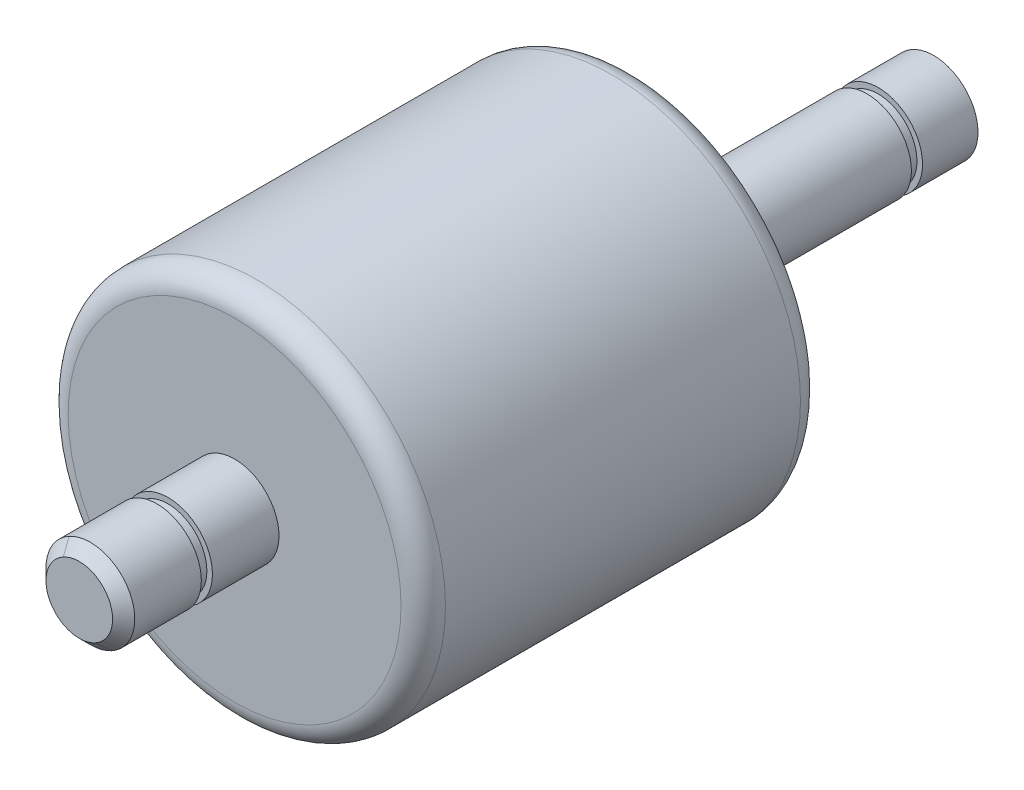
ISO-10303-21;
HEADER;
FILE_DESCRIPTION(('STEP AP214'),'2;1');
FILE_NAME('part.step','',(''),(''),'','','');
FILE_SCHEMA(('AUTOMOTIVE_DESIGN { 1 0 10303 214 1 1 1 1 }'));
ENDSEC;
DATA;
#1=APPLICATION_CONTEXT('core data for automotive mechanical design processes');
#2=APPLICATION_PROTOCOL_DEFINITION('international standard','automotive_design',2000,#1);
#3=PRODUCT_CONTEXT('',#1,'mechanical');
#4=PRODUCT('Part','Part','',(#3));
#5=PRODUCT_RELATED_PRODUCT_CATEGORY('part','',(#4));
#6=PRODUCT_DEFINITION_FORMATION('','',#4);
#7=PRODUCT_DEFINITION_CONTEXT('part definition',#1,'design');
#8=PRODUCT_DEFINITION('design','',#6,#7);
#9=PRODUCT_DEFINITION_SHAPE('','',#8);
#10=(LENGTH_UNIT() NAMED_UNIT(*) SI_UNIT(.MILLI.,.METRE.));
#11=(NAMED_UNIT(*) PLANE_ANGLE_UNIT() SI_UNIT($,.RADIAN.));
#12=(NAMED_UNIT(*) SI_UNIT($,.STERADIAN.) SOLID_ANGLE_UNIT());
#13=UNCERTAINTY_MEASURE_WITH_UNIT(LENGTH_MEASURE(1.E-05),#10,'distance_accuracy_value','');
#14=(GEOMETRIC_REPRESENTATION_CONTEXT(3) GLOBAL_UNCERTAINTY_ASSIGNED_CONTEXT((#13)) GLOBAL_UNIT_ASSIGNED_CONTEXT((#10,
#11,#12)) REPRESENTATION_CONTEXT('',''));
#15=CARTESIAN_POINT('',(0.,0.,0.));
#16=DIRECTION('',(0.,0.,1.));
#17=DIRECTION('',(1.,0.,0.));
#18=AXIS2_PLACEMENT_3D('',#15,#16,#17);
#19=CARTESIAN_POINT('',(0.,-4.,93.));
#20=DIRECTION('',(0.,0.,1.));
#21=DIRECTION('',(1.,0.,0.));
#22=AXIS2_PLACEMENT_3D('',#19,#20,#21);
#23=PLANE('',#22);
#24=CARTESIAN_POINT('',(2.10843322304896E-13,2.55510338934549E-13,93.000000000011));
#25=DIRECTION('',(-2.10409641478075E-13,-2.55293498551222E-13,-1.));
#26=DIRECTION('',(0.,1.,-2.55293498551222E-13));
#27=AXIS2_PLACEMENT_3D('',#24,#25,#26);
#28=CIRCLE('',#27,2.99999999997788);
#29=CARTESIAN_POINT('',(-1.43827649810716,2.6327477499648,93.0000000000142));
#30=VERTEX_POINT('',#29);
#31=CARTESIAN_POINT('',(1.43827661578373,-2.63274768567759,93.0000000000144));
#32=VERTEX_POINT('',#31);
#33=EDGE_CURVE('E67',#30,#32,#28,.T.);
#34=ORIENTED_EDGE('',*,*,#33,.F.);
#35=CARTESIAN_POINT('',(0.,0.,93.0000000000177));
#36=DIRECTION('',(0.,0.,-1.));
#37=DIRECTION('',(-1.,0.,0.));
#38=AXIS2_PLACEMENT_3D('',#35,#36,#37);
#39=CIRCLE('',#38,3.00000000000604);
#40=EDGE_CURVE('E56',#32,#30,#39,.T.);
#41=ORIENTED_EDGE('',*,*,#40,.F.);
#42=EDGE_LOOP('',(#34,#41));
#43=FACE_BOUND('',#42,.T.);
#44=ADVANCED_FACE('F16',(#43),#23,.T.);
#45=CARTESIAN_POINT('',(0.,0.,91.9999999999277));
#46=DIRECTION('',(0.,0.,-1.));
#47=DIRECTION('',(-1.,0.,0.));
#48=AXIS2_PLACEMENT_3D('',#45,#46,#47);
#49=CONICAL_SURFACE('',#48,4.00000000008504,0.785398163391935);
#50=DIRECTION('',(-0.339005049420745,0.620544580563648,0.707106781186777));
#51=VECTOR('',#50,1.);
#52=CARTESIAN_POINT('',(239279.368614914,-437997.946309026,-499000.));
#53=LINE('',#52,#51);
#54=CARTESIAN_POINT('',(1.91770215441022,-3.51033024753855,92.0000000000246));
#55=VERTEX_POINT('',#54);
#56=EDGE_CURVE('E64',#32,#55,#53,.F.);
#57=ORIENTED_EDGE('',*,*,#56,.F.);
#58=ORIENTED_EDGE('',*,*,#40,.T.);
#59=CARTESIAN_POINT('',(-1.91770215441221,3.51033024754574,92.0000000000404));
#60=CARTESIAN_POINT('',(-1.89772608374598,3.47376431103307,92.0416666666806));
#61=CARTESIAN_POINT('',(-1.87775001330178,3.43719837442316,92.0833333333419));
#62=CARTESIAN_POINT('',(-1.83779787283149,3.36406650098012,92.1666666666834));
#63=CARTESIAN_POINT('',(-1.8178218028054,3.32750056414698,92.2083333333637));
#64=CARTESIAN_POINT('',(-1.77786966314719,3.25436869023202,92.291666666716));
#65=CARTESIAN_POINT('',(-1.75789359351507,3.21780275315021,92.3333333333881));
#66=CARTESIAN_POINT('',(-1.71794145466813,3.14467087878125,92.416666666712));
#67=CARTESIAN_POINT('',(-1.6979653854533,3.1081049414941,92.4583333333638));
#68=CARTESIAN_POINT('',(-1.65801324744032,3.03497306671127,92.5416666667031));
#69=CARTESIAN_POINT('',(-1.63803717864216,2.99840712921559,92.5833333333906));
#70=CARTESIAN_POINT('',(-1.59808504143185,2.92527525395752,92.6666666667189));
#71=CARTESIAN_POINT('',(-1.5781089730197,2.88870931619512,92.7083333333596));
#72=CARTESIAN_POINT('',(-1.53815683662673,2.81557744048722,92.791666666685));
#73=CARTESIAN_POINT('',(-1.51818076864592,2.77901150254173,92.8333333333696));
#74=CARTESIAN_POINT('',(-1.47822863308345,2.70587962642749,92.9166666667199));
#75=CARTESIAN_POINT('',(-1.45825256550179,2.66931368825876,92.9583333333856));
#76=CARTESIAN_POINT('',(-1.43827649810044,2.6327477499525,93.000000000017));
#77=B_SPLINE_CURVE_WITH_KNOTS('',3,(#59,#60,#61,#62,#63,#64,#65,#66,#67,#68,#69,#70,#71,#72,#73,
#74,#75,#76),.UNSPECIFIED.,.F.,.F.,(4,2,2,2,2,2,2,2,4),(0.,0.176776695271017,0.353553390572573,
0.530330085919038,0.7071067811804,0.883883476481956,1.06066017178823,1.23743686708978,
1.41421356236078),.UNSPECIFIED.);
#78=CARTESIAN_POINT('',(-1.91770215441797,3.51033024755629,92.0000000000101));
#79=VERTEX_POINT('',#78);
#80=EDGE_CURVE('E61',#79,#30,#77,.T.);
#81=ORIENTED_EDGE('',*,*,#80,.F.);
#82=CARTESIAN_POINT('',(0.,0.,92.));
#83=DIRECTION('',(0.,0.,1.));
#84=DIRECTION('',(1.,0.,0.));
#85=AXIS2_PLACEMENT_3D('',#82,#83,#84);
#86=CIRCLE('',#85,4.);
#87=EDGE_CURVE('E69',#55,#79,#86,.F.);
#88=ORIENTED_EDGE('',*,*,#87,.F.);
#89=EDGE_LOOP('',(#57,#58,#81,#88));
#90=FACE_BOUND('',#89,.T.);
#91=ADVANCED_FACE('F59',(#90),#49,.T.);
#92=CARTESIAN_POINT('',(0.,0.,92.0000000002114));
#93=DIRECTION('',(-2.10409641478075E-13,-2.55293498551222E-13,-1.));
#94=DIRECTION('',(0.,1.,-2.55293498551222E-13));
#95=AXIS2_PLACEMENT_3D('',#92,#93,#94);
#96=CONICAL_SURFACE('',#95,3.99999999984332,0.78539816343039);
#97=ORIENTED_EDGE('',*,*,#80,.T.);
#98=ORIENTED_EDGE('',*,*,#33,.T.);
#99=ORIENTED_EDGE('',*,*,#56,.T.);
#100=CARTESIAN_POINT('',(0.,0.,92.));
#101=DIRECTION('',(0.,0.,1.));
#102=DIRECTION('',(1.,0.,0.));
#103=AXIS2_PLACEMENT_3D('',#100,#101,#102);
#104=CIRCLE('',#103,4.);
#105=EDGE_CURVE('E74',#79,#55,#104,.F.);
#106=ORIENTED_EDGE('',*,*,#105,.F.);
#107=EDGE_LOOP('',(#97,#98,#99,#106));
#108=FACE_BOUND('',#107,.T.);
#109=ADVANCED_FACE('F72',(#108),#96,.T.);
#110=CARTESIAN_POINT('',(0.,-4.,16.));
#111=DIRECTION('',(0.,0.,1.));
#112=DIRECTION('',(1.,0.,0.));
#113=AXIS2_PLACEMENT_3D('',#110,#111,#112);
#114=PLANE('',#113);
#115=CARTESIAN_POINT('',(0.,0.,16.));
#116=DIRECTION('',(0.,0.,1.));
#117=DIRECTION('',(1.,0.,0.));
#118=AXIS2_PLACEMENT_3D('',#115,#116,#117);
#119=CIRCLE('',#118,4.);
#120=CARTESIAN_POINT('',(4.,0.,16.));
#121=VERTEX_POINT('',#120);
#122=EDGE_CURVE('E102',#121,#121,#119,.T.);
#123=ORIENTED_EDGE('',*,*,#122,.F.);
#124=EDGE_LOOP('',(#123));
#125=FACE_BOUND('',#124,.T.);
#126=ADVANCED_FACE('F94',(#125),#114,.F.);
#127=CARTESIAN_POINT('',(0.,0.,54.5));
#128=DIRECTION('',(0.,0.,1.));
#129=DIRECTION('',(1.,0.,0.));
#130=AXIS2_PLACEMENT_3D('',#127,#128,#129);
#131=CYLINDRICAL_SURFACE('',#130,4.);
#132=CARTESIAN_POINT('',(0.,0.,86.));
#133=DIRECTION('',(0.,0.,1.));
#134=DIRECTION('',(1.,0.,0.));
#135=AXIS2_PLACEMENT_3D('',#132,#133,#134);
#136=CIRCLE('',#135,4.);
#137=CARTESIAN_POINT('',(4.,0.,86.));
#138=VERTEX_POINT('',#137);
#139=EDGE_CURVE('E105',#138,#138,#136,.T.);
#140=ORIENTED_EDGE('',*,*,#139,.T.);
#141=EDGE_LOOP('',(#140));
#142=FACE_BOUND('',#141,.T.);
#143=ORIENTED_EDGE('',*,*,#105,.T.);
#144=ORIENTED_EDGE('',*,*,#87,.T.);
#145=EDGE_LOOP('',(#143,#144));
#146=FACE_BOUND('',#145,.T.);
#147=ADVANCED_FACE('F240',(#142,#146),#131,.T.);
#148=CARTESIAN_POINT('',(0.,0.,54.5));
#149=DIRECTION('',(0.,0.,1.));
#150=DIRECTION('',(1.,0.,0.));
#151=AXIS2_PLACEMENT_3D('',#148,#149,#150);
#152=CYLINDRICAL_SURFACE('',#151,4.);
#153=ORIENTED_EDGE('',*,*,#122,.T.);
#154=EDGE_LOOP('',(#153));
#155=FACE_BOUND('',#154,.T.);
#156=CARTESIAN_POINT('',(0.,0.,21.));
#157=DIRECTION('',(0.,0.,1.));
#158=DIRECTION('',(1.,0.,0.));
#159=AXIS2_PLACEMENT_3D('',#156,#157,#158);
#160=CIRCLE('',#159,4.);
#161=CARTESIAN_POINT('',(4.,0.,21.));
#162=VERTEX_POINT('',#161);
#163=EDGE_CURVE('E110',#162,#162,#160,.T.);
#164=ORIENTED_EDGE('',*,*,#163,.F.);
#165=EDGE_LOOP('',(#164));
#166=FACE_BOUND('',#165,.T.);
#167=ADVANCED_FACE('F237',(#155,#166),#152,.T.);
#168=CARTESIAN_POINT('',(0.,-11.1014213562,86.));
#169=DIRECTION('',(0.,0.,1.));
#170=DIRECTION('',(1.,0.,0.));
#171=AXIS2_PLACEMENT_3D('',#168,#169,#170);
#172=PLANE('',#171);
#173=CARTESIAN_POINT('',(0.,0.,86.));
#174=DIRECTION('',(0.,0.,1.));
#175=DIRECTION('',(1.,0.,0.));
#176=AXIS2_PLACEMENT_3D('',#173,#174,#175);
#177=CIRCLE('',#176,3.5);
#178=CARTESIAN_POINT('',(3.5,0.,86.));
#179=VERTEX_POINT('',#178);
#180=EDGE_CURVE('E230',#179,#179,#177,.F.);
#181=ORIENTED_EDGE('',*,*,#180,.F.);
#182=EDGE_LOOP('',(#181));
#183=FACE_BOUND('',#182,.T.);
#184=ORIENTED_EDGE('',*,*,#139,.F.);
#185=EDGE_LOOP('',(#184));
#186=FACE_BOUND('',#185,.T.);
#187=ADVANCED_FACE('F239',(#183,#186),#172,.F.);
#188=CARTESIAN_POINT('',(0.,-3.5,21.));
#189=DIRECTION('',(0.,0.,1.));
#190=DIRECTION('',(1.,0.,0.));
#191=AXIS2_PLACEMENT_3D('',#188,#189,#190);
#192=PLANE('',#191);
#193=CARTESIAN_POINT('',(0.,0.,21.));
#194=DIRECTION('',(0.,0.,1.));
#195=DIRECTION('',(1.,0.,0.));
#196=AXIS2_PLACEMENT_3D('',#193,#194,#195);
#197=CIRCLE('',#196,3.5);
#198=CARTESIAN_POINT('',(3.5,0.,21.));
#199=VERTEX_POINT('',#198);
#200=EDGE_CURVE('E227',#199,#199,#197,.T.);
#201=ORIENTED_EDGE('',*,*,#200,.F.);
#202=EDGE_LOOP('',(#201));
#203=FACE_BOUND('',#202,.T.);
#204=ORIENTED_EDGE('',*,*,#163,.T.);
#205=EDGE_LOOP('',(#204));
#206=FACE_BOUND('',#205,.T.);
#207=ADVANCED_FACE('F235',(#203,#206),#192,.T.);
#208=CARTESIAN_POINT('',(0.,0.,53.5));
#209=DIRECTION('',(0.,0.,1.));
#210=DIRECTION('',(1.,0.,0.));
#211=AXIS2_PLACEMENT_3D('',#208,#209,#210);
#212=CYLINDRICAL_SURFACE('',#211,3.5);
#213=ORIENTED_EDGE('',*,*,#180,.T.);
#214=EDGE_LOOP('',(#213));
#215=FACE_BOUND('',#214,.T.);
#216=CARTESIAN_POINT('',(0.,0.,85.));
#217=DIRECTION('',(0.,0.,1.));
#218=DIRECTION('',(1.,0.,0.));
#219=AXIS2_PLACEMENT_3D('',#216,#217,#218);
#220=CIRCLE('',#219,3.5);
#221=CARTESIAN_POINT('',(3.5,0.,85.));
#222=VERTEX_POINT('',#221);
#223=EDGE_CURVE('E224',#222,#222,#220,.F.);
#224=ORIENTED_EDGE('',*,*,#223,.F.);
#225=EDGE_LOOP('',(#224));
#226=FACE_BOUND('',#225,.T.);
#227=ADVANCED_FACE('F338',(#215,#226),#212,.T.);
#228=CARTESIAN_POINT('',(0.,0.,53.5));
#229=DIRECTION('',(0.,0.,1.));
#230=DIRECTION('',(1.,0.,0.));
#231=AXIS2_PLACEMENT_3D('',#228,#229,#230);
#232=CYLINDRICAL_SURFACE('',#231,3.5);
#233=CARTESIAN_POINT('',(0.,0.,22.));
#234=DIRECTION('',(0.,0.,1.));
#235=DIRECTION('',(1.,0.,0.));
#236=AXIS2_PLACEMENT_3D('',#233,#234,#235);
#237=CIRCLE('',#236,3.5);
#238=CARTESIAN_POINT('',(3.5,0.,22.));
#239=VERTEX_POINT('',#238);
#240=EDGE_CURVE('E221',#239,#239,#237,.F.);
#241=ORIENTED_EDGE('',*,*,#240,.T.);
#242=EDGE_LOOP('',(#241));
#243=FACE_BOUND('',#242,.T.);
#244=ORIENTED_EDGE('',*,*,#200,.T.);
#245=EDGE_LOOP('',(#244));
#246=FACE_BOUND('',#245,.T.);
#247=ADVANCED_FACE('F329',(#243,#246),#232,.T.);
#248=CARTESIAN_POINT('',(0.,-3.5,85.));
#249=DIRECTION('',(0.,0.,1.));
#250=DIRECTION('',(1.,0.,0.));
#251=AXIS2_PLACEMENT_3D('',#248,#249,#250);
#252=PLANE('',#251);
#253=ORIENTED_EDGE('',*,*,#223,.T.);
#254=EDGE_LOOP('',(#253));
#255=FACE_BOUND('',#254,.T.);
#256=CARTESIAN_POINT('',(0.,0.,85.));
#257=DIRECTION('',(0.,0.,1.));
#258=DIRECTION('',(1.,0.,0.));
#259=AXIS2_PLACEMENT_3D('',#256,#257,#258);
#260=CIRCLE('',#259,4.);
#261=CARTESIAN_POINT('',(4.,0.,85.));
#262=VERTEX_POINT('',#261);
#263=EDGE_CURVE('E218',#262,#262,#260,.F.);
#264=ORIENTED_EDGE('',*,*,#263,.F.);
#265=EDGE_LOOP('',(#264));
#266=FACE_BOUND('',#265,.T.);
#267=ADVANCED_FACE('F320',(#255,#266),#252,.T.);
#268=CARTESIAN_POINT('',(0.,-11.1014213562,22.));
#269=DIRECTION('',(0.,0.,1.));
#270=DIRECTION('',(1.,0.,0.));
#271=AXIS2_PLACEMENT_3D('',#268,#269,#270);
#272=PLANE('',#271);
#273=ORIENTED_EDGE('',*,*,#240,.F.);
#274=EDGE_LOOP('',(#273));
#275=FACE_BOUND('',#274,.T.);
#276=CARTESIAN_POINT('',(0.,0.,22.));
#277=DIRECTION('',(0.,0.,1.));
#278=DIRECTION('',(1.,0.,0.));
#279=AXIS2_PLACEMENT_3D('',#276,#277,#278);
#280=CIRCLE('',#279,4.);
#281=CARTESIAN_POINT('',(4.,0.,22.));
#282=VERTEX_POINT('',#281);
#283=EDGE_CURVE('E215',#282,#282,#280,.T.);
#284=ORIENTED_EDGE('',*,*,#283,.F.);
#285=EDGE_LOOP('',(#284));
#286=FACE_BOUND('',#285,.T.);
#287=ADVANCED_FACE('F311',(#275,#286),#272,.F.);
#288=CARTESIAN_POINT('',(0.,0.,54.5));
#289=DIRECTION('',(0.,0.,1.));
#290=DIRECTION('',(1.,0.,0.));
#291=AXIS2_PLACEMENT_3D('',#288,#289,#290);
#292=CYLINDRICAL_SURFACE('',#291,4.);
#293=CARTESIAN_POINT('',(0.,0.,79.));
#294=DIRECTION('',(0.,0.,1.));
#295=DIRECTION('',(1.,0.,0.));
#296=AXIS2_PLACEMENT_3D('',#293,#294,#295);
#297=CIRCLE('',#296,4.);
#298=CARTESIAN_POINT('',(4.,0.,79.));
#299=VERTEX_POINT('',#298);
#300=EDGE_CURVE('E210',#299,#299,#297,.F.);
#301=ORIENTED_EDGE('',*,*,#300,.F.);
#302=EDGE_LOOP('',(#301));
#303=FACE_BOUND('',#302,.T.);
#304=ORIENTED_EDGE('',*,*,#263,.T.);
#305=EDGE_LOOP('',(#304));
#306=FACE_BOUND('',#305,.T.);
#307=ADVANCED_FACE('F304',(#303,#306),#292,.T.);
#308=CARTESIAN_POINT('',(0.,0.,54.5));
#309=DIRECTION('',(0.,0.,1.));
#310=DIRECTION('',(1.,0.,0.));
#311=AXIS2_PLACEMENT_3D('',#308,#309,#310);
#312=CYLINDRICAL_SURFACE('',#311,4.);
#313=CARTESIAN_POINT('',(0.,0.,43.));
#314=DIRECTION('',(0.,0.,1.));
#315=DIRECTION('',(1.,0.,0.));
#316=AXIS2_PLACEMENT_3D('',#313,#314,#315);
#317=CIRCLE('',#316,4.);
#318=CARTESIAN_POINT('',(4.,0.,43.));
#319=VERTEX_POINT('',#318);
#320=EDGE_CURVE('E205',#319,#319,#317,.F.);
#321=ORIENTED_EDGE('',*,*,#320,.T.);
#322=EDGE_LOOP('',(#321));
#323=FACE_BOUND('',#322,.T.);
#324=ORIENTED_EDGE('',*,*,#283,.T.);
#325=EDGE_LOOP('',(#324));
#326=FACE_BOUND('',#325,.T.);
#327=ADVANCED_FACE('F296',(#323,#326),#312,.T.);
#328=CARTESIAN_POINT('',(0.,-17.,79.));
#329=DIRECTION('',(0.,0.,1.));
#330=DIRECTION('',(1.,0.,0.));
#331=AXIS2_PLACEMENT_3D('',#328,#329,#330);
#332=PLANE('',#331);
#333=ORIENTED_EDGE('',*,*,#300,.T.);
#334=EDGE_LOOP('',(#333));
#335=FACE_BOUND('',#334,.T.);
#336=CARTESIAN_POINT('',(0.,0.,79.));
#337=DIRECTION('',(0.,0.,-1.));
#338=DIRECTION('',(-0.479425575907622,0.877582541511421,0.));
#339=AXIS2_PLACEMENT_3D('',#336,#337,#338);
#340=CIRCLE('',#339,15.0000000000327);
#341=CARTESIAN_POINT('',(-7.19138352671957,13.1637381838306,79.));
#342=VERTEX_POINT('',#341);
#343=CARTESIAN_POINT('',(7.19138307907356,-13.1637384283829,79.));
#344=VERTEX_POINT('',#343);
#345=EDGE_CURVE('E177',#342,#344,#340,.T.);
#346=ORIENTED_EDGE('',*,*,#345,.F.);
#347=CARTESIAN_POINT('',(0.,0.,79.));
#348=DIRECTION('',(0.,0.,-1.));
#349=DIRECTION('',(0.479425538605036,-0.877582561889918,0.));
#350=AXIS2_PLACEMENT_3D('',#347,#348,#349);
#351=CIRCLE('',#350,15.0000000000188);
#352=EDGE_CURVE('E188',#344,#342,#351,.T.);
#353=ORIENTED_EDGE('',*,*,#352,.F.);
#354=EDGE_LOOP('',(#346,#353));
#355=FACE_BOUND('',#354,.T.);
#356=ADVANCED_FACE('F152',(#335,#355),#332,.T.);
#357=CARTESIAN_POINT('',(0.,-4.,43.));
#358=DIRECTION('',(0.,0.,1.));
#359=DIRECTION('',(1.,0.,0.));
#360=AXIS2_PLACEMENT_3D('',#357,#358,#359);
#361=PLANE('',#360);
#362=ORIENTED_EDGE('',*,*,#320,.F.);
#363=EDGE_LOOP('',(#362));
#364=FACE_BOUND('',#363,.T.);
#365=CARTESIAN_POINT('',(7.19138307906,-13.1637384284,43.));
#366=CARTESIAN_POINT('',(7.40677695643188,-13.0460741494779,43.));
#367=CARTESIAN_POINT('',(7.61927751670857,-12.9231146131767,43.));
#368=CARTESIAN_POINT('',(8.03799201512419,-12.666920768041,43.));
#369=CARTESIAN_POINT('',(8.24420595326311,-12.5336864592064,43.));
#370=CARTESIAN_POINT('',(8.64984721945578,-12.2572588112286,43.));
#371=CARTESIAN_POINT('',(8.84927454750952,-12.1140654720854,43.));
#372=CARTESIAN_POINT('',(9.24086301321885,-11.8180661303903,43.));
#373=CARTESIAN_POINT('',(9.43302415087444,-11.6652601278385,43.));
#374=CARTESIAN_POINT('',(9.80961707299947,-11.3504032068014,43.));
#375=CARTESIAN_POINT('',(9.9940488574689,-11.1883522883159,43.));
#376=CARTESIAN_POINT('',(10.3547388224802,-10.8553960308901,43.));
#377=CARTESIAN_POINT('',(10.5309970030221,-10.6844906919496,43.));
#378=CARTESIAN_POINT('',(10.8749151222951,-10.334237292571,43.));
#379=CARTESIAN_POINT('',(11.0425750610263,-10.1548892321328,43.));
#380=CARTESIAN_POINT('',(11.3688927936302,-9.7881824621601,43.));
#381=CARTESIAN_POINT('',(11.527550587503,-9.60082375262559,43.));
#382=CARTESIAN_POINT('',(11.8354818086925,-9.2185470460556,43.));
#383=CARTESIAN_POINT('',(11.9847552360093,-9.02362904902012,43.));
#384=CARTESIAN_POINT('',(12.2735581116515,-8.62670334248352,43.));
#385=CARTESIAN_POINT('',(12.413087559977,-8.42469563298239,43.));
#386=CARTESIAN_POINT('',(12.682066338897,-8.01407715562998,43.));
#387=CARTESIAN_POINT('',(12.8115156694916,-7.8054663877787,43.));
#388=CARTESIAN_POINT('',(13.0600223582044,-7.38214435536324,43.));
#389=CARTESIAN_POINT('',(13.1790797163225,-7.16743309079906,43.));
#390=CARTESIAN_POINT('',(13.4065156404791,-6.73242732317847,43.));
#391=CARTESIAN_POINT('',(13.5148942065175,-6.51213282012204,43.));
#392=CARTESIAN_POINT('',(13.720711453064,-6.06649128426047,43.));
#393=CARTESIAN_POINT('',(13.8181501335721,-5.84114425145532,43.));
#394=CARTESIAN_POINT('',(14.001852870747,-5.38594053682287,43.));
#395=CARTESIAN_POINT('',(14.0881169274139,-5.15608385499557,43.));
#396=CARTESIAN_POINT('',(14.2492625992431,-4.6924145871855,43.));
#397=CARTESIAN_POINT('',(14.3241442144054,-4.45860200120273,43.));
#398=CARTESIAN_POINT('',(14.46234460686,-3.98758420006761,43.));
#399=CARTESIAN_POINT('',(14.5256633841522,-3.75037898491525,43.));
#400=CARTESIAN_POINT('',(14.6405855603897,-3.27314737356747,43.));
#401=CARTESIAN_POINT('',(14.6921889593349,-3.03312097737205,43.));
#402=CARTESIAN_POINT('',(14.7835560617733,-2.55082524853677,43.));
#403=CARTESIAN_POINT('',(14.8233197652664,-2.3085559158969,43.));
#404=CARTESIAN_POINT('',(14.8909116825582,-1.82235796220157,43.));
#405=CARTESIAN_POINT('',(14.9187398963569,-1.5784293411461,43.));
#406=CARTESIAN_POINT('',(14.9623937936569,-1.08950045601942,43.));
#407=CARTESIAN_POINT('',(14.9782194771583,-0.844500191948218,43.));
#408=CARTESIAN_POINT('',(14.9978301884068,-0.354018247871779,43.));
#409=CARTESIAN_POINT('',(15.001615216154,-0.108536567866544,43.));
#410=CARTESIAN_POINT('',(14.997135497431,0.382316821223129,43.));
#411=CARTESIAN_POINT('',(14.9888707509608,0.627688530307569,43.));
#412=CARTESIAN_POINT('',(14.9603113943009,1.1177308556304,43.));
#413=CARTESIAN_POINT('',(14.9400167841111,1.36240147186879,43.));
#414=CARTESIAN_POINT('',(14.8874465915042,1.85045217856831,43.));
#415=CARTESIAN_POINT('',(14.8551710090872,2.09383226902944,43.));
#416=CARTESIAN_POINT('',(14.7787166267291,2.57871560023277,43.));
#417=CARTESIAN_POINT('',(14.734537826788,2.82021884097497,43.));
#418=CARTESIAN_POINT('',(14.6343834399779,3.30076667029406,43.));
#419=CARTESIAN_POINT('',(14.5784078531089,3.53981125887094,43.));
#420=CARTESIAN_POINT('',(14.4547947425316,4.01486590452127,43.));
#421=CARTESIAN_POINT('',(14.3871572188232,4.25087596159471,43.));
#422=CARTESIAN_POINT('',(14.2403831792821,4.71929297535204,43.));
#423=CARTESIAN_POINT('',(14.1612466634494,4.95169993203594,43.));
#424=CARTESIAN_POINT('',(13.9916652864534,5.41235085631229,43.));
#425=CARTESIAN_POINT('',(13.9012204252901,5.64059482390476,43.));
#426=CARTESIAN_POINT('',(13.7092402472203,6.09236991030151,43.));
#427=CARTESIAN_POINT('',(13.6077049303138,6.31590102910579,43.));
#428=CARTESIAN_POINT('',(13.3937884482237,6.75771191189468,43.));
#429=CARTESIAN_POINT('',(13.2814072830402,6.97599167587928,43.));
#430=CARTESIAN_POINT('',(13.0460698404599,7.40677399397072,43.));
#431=CARTESIAN_POINT('',(12.9231135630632,7.61927654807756,43.));
#432=CARTESIAN_POINT('',(12.6669221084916,8.0379925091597,43.));
#433=CARTESIAN_POINT('',(12.5336869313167,8.244205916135,43.));
#434=CARTESIAN_POINT('',(12.257258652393,8.64984679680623,43.));
#435=CARTESIAN_POINT('',(12.1140655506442,8.84927427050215,43.));
#436=CARTESIAN_POINT('',(11.8180663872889,9.24086284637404,43.));
#437=CARTESIAN_POINT('',(11.6652603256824,9.43302394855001,43.));
#438=CARTESIAN_POINT('',(11.3504033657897,9.80961684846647,43.));
#439=CARTESIAN_POINT('',(11.1883524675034,9.99404864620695,43.));
#440=CARTESIAN_POINT('',(10.8553962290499,10.3547386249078,43.));
#441=CARTESIAN_POINT('',(10.6844908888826,10.5309968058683,43.));
#442=CARTESIAN_POINT('',(10.3342374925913,10.8749149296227,43.));
#443=CARTESIAN_POINT('',(10.1548894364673,11.0425748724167,43.));
#444=CARTESIAN_POINT('',(9.78818267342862,11.3688926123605,43.));
#445=CARTESIAN_POINT('',(9.60082396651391,11.5275504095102,43.));
#446=CARTESIAN_POINT('',(9.21854726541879,11.8354816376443,43.));
#447=CARTESIAN_POINT('',(9.02362927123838,11.9847550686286,43.));
#448=CARTESIAN_POINT('',(8.62670357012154,12.2735579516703,43.));
#449=CARTESIAN_POINT('',(8.42469586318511,12.4130874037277,43.));
#450=CARTESIAN_POINT('',(8.01407739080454,12.6820661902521,43.));
#451=CARTESIAN_POINT('',(7.80546662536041,12.8115155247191,43.));
#452=CARTESIAN_POINT('',(7.38214459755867,13.060022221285,43.));
#453=CARTESIAN_POINT('',(7.16743333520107,13.1790795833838,43.));
#454=CARTESIAN_POINT('',(6.73242757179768,13.4065155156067,43.));
#455=CARTESIAN_POINT('',(6.5121330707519,13.5148940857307,43.));
#456=CARTESIAN_POINT('',(6.06649153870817,13.7207113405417,43.));
#457=CARTESIAN_POINT('',(5.84114450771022,13.8181500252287,43.));
#458=CARTESIAN_POINT('',(5.38594079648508,14.0018527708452,43.));
#459=CARTESIAN_POINT('',(5.15608411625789,14.0881168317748,43.));
#460=CARTESIAN_POINT('',(4.69241485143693,14.2492625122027,43.));
#461=CARTESIAN_POINT('',(4.45860226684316,14.3241441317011,43.));
#462=CARTESIAN_POINT('',(3.9875844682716,14.4623445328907,43.));
#463=CARTESIAN_POINT('',(3.75037925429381,14.5256633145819,43.));
#464=CARTESIAN_POINT('',(3.2731476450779,14.6405854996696,43.));
#465=CARTESIAN_POINT('',(3.03312124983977,14.6921889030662,43.));
#466=CARTESIAN_POINT('',(2.55082552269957,14.7835560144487,43.));
#467=CARTESIAN_POINT('',(2.3085561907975,14.8233197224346,43.));
#468=CARTESIAN_POINT('',(1.82235823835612,14.8909116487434,43.));
#469=CARTESIAN_POINT('',(1.57842961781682,14.9187398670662,43.));
#470=CARTESIAN_POINT('',(1.08950073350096,14.9623937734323,43.));
#471=CARTESIAN_POINT('',(0.844500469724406,14.9782194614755,43.));
#472=CARTESIAN_POINT('',(0.354018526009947,14.9978301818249,43.));
#473=CARTESIAN_POINT('',(0.10853684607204,15.0016152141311,43.));
#474=CARTESIAN_POINT('',(-0.38231654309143,14.9971355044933,43.));
#475=CARTESIAN_POINT('',(-0.627688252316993,14.9888707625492,43.));
#476=CARTESIAN_POINT('',(-1.11773057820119,14.9603114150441,43.));
#477=CARTESIAN_POINT('',(-1.36240119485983,14.9400168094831,43.));
#478=CARTESIAN_POINT('',(-1.85045190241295,14.887446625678,43.));
#479=CARTESIAN_POINT('',(-2.09383199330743,14.855171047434,43.));
#480=CARTESIAN_POINT('',(-2.57871532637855,14.7787166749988,43.));
#481=CARTESIAN_POINT('',(-2.82021856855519,14.7345378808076,43.));
#482=CARTESIAN_POINT('',(-3.30076639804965,14.6343834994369,43.));
#483=CARTESIAN_POINT('',(-3.53981098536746,14.5784079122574,43.));
#484=CARTESIAN_POINT('',(-4.01486563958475,14.4547948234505,43.));
#485=CARTESIAN_POINT('',(-4.25087570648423,14.3871573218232,43.));
#486=CARTESIAN_POINT('',(-4.71929269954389,14.2403832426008,43.));
#487=CARTESIAN_POINT('',(-4.95169962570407,14.1612466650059,43.));
#488=CARTESIAN_POINT('',(-5.41235064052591,13.9916654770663,43.));
#489=CARTESIAN_POINT('',(-5.64059472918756,13.9012208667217,43.));
#490=CARTESIAN_POINT('',(-6.09236949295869,13.7092400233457,43.));
#491=CARTESIAN_POINT('',(-6.31590016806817,13.6077037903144,43.));
#492=CARTESIAN_POINT('',(-6.75771227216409,13.3937898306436,43.));
#493=CARTESIAN_POINT('',(-6.97599370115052,13.2814121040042,43.));
#494=CARTESIAN_POINT('',(-7.19138259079,13.1637386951,43.));
#495=B_SPLINE_CURVE_WITH_KNOTS('',3,(#365,#366,#367,#368,#369,#370,#371,#372,#373,#374,#375,
#376,#377,#378,#379,#380,#381,#382,#383,#384,#385,#386,#387,#388,#389,#390,#391,#392,#393,#394,
#395,#396,#397,#398,#399,#400,#401,#402,#403,#404,#405,#406,#407,#408,#409,#410,#411,#412,#413,
#414,#415,#416,#417,#418,#419,#420,#421,#422,#423,#424,#425,#426,#427,#428,#429,#430,#431,#432,
#433,#434,#435,#436,#437,#438,#439,#440,#441,#442,#443,#444,#445,#446,#447,#448,#449,#450,#451,
#452,#453,#454,#455,#456,#457,#458,#459,#460,#461,#462,#463,#464,#465,#466,#467,#468,#469,#470,
#471,#472,#473,#474,#475,#476,#477,#478,#479,#480,#481,#482,#483,#484,#485,#486,#487,#488,#489,
#490,#491,#492,#493,#494),.UNSPECIFIED.,.F.,.F.,(4,2,2,2,2,2,2,2,2,2,2,2,2,2,2,2,2,2,2,2,2,2,2,
2,2,2,2,2,2,2,2,2,2,2,2,2,2,2,2,2,2,2,2,2,2,2,2,2,2,2,2,2,2,2,2,2,2,2,2,2,2,2,2,2,4),(0.,
0.736236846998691,1.47247369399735,2.20871054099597,2.94494738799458,3.68118423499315,
4.41742108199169,5.15365792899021,5.88989477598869,6.62613162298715,7.36236846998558,
8.09860531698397,8.83484216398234,9.57107901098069,10.307315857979,11.0435527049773,
11.7797895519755,12.5160263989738,13.252263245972,13.9885000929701,14.7247369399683,
15.4609737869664,16.1972106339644,16.9334474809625,17.6696843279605,18.4059211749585,
19.1421580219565,19.8783948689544,20.6146317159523,21.3508685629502,22.087105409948,
22.8233422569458,23.5595791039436,24.2958159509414,25.0320527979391,25.7682896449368,
26.5045264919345,27.2407633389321,27.9770001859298,28.7132370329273,29.4494738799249,
30.1857107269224,30.9219475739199,31.6581844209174,32.3944212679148,33.1306581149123,
33.8668949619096,34.603131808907,35.3393686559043,36.0756055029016,36.8118423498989,
37.5480791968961,38.2843160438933,39.0205528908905,39.7567897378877,40.4930265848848,
41.2292634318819,41.9655002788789,42.701737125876,43.437973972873,44.1742108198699,
44.9104476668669,45.6466845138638,46.3829213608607,47.1191582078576),.UNSPECIFIED.);
#496=CARTESIAN_POINT('',(7.19138307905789,-13.1637384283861,43.));
#497=VERTEX_POINT('',#496);
#498=CARTESIAN_POINT('',(-7.19138278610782,13.1637385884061,43.));
#499=VERTEX_POINT('',#498);
#500=EDGE_CURVE('E35',#497,#499,#495,.T.);
#501=ORIENTED_EDGE('',*,*,#500,.F.);
#502=CARTESIAN_POINT('',(0.,0.,43.));
#503=DIRECTION('',(0.,0.,1.));
#504=DIRECTION('',(-0.479425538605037,0.877582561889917,0.));
#505=AXIS2_PLACEMENT_3D('',#502,#503,#504);
#506=CIRCLE('',#505,14.9999999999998);
#507=EDGE_CURVE('E165',#499,#497,#506,.T.);
#508=ORIENTED_EDGE('',*,*,#507,.F.);
#509=EDGE_LOOP('',(#501,#508));
#510=FACE_BOUND('',#509,.T.);
#511=ADVANCED_FACE('F143',(#364,#510),#361,.F.);
#512=CARTESIAN_POINT('',(0.,0.,77.));
#513=DIRECTION('',(0.,0.,1.));
#514=DIRECTION('',(-0.140783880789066,0.990040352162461,0.));
#515=AXIS2_PLACEMENT_3D('',#512,#513,#514);
#516=TOROIDAL_SURFACE('',#515,15.,2.);
#517=CARTESIAN_POINT('',(0.,0.,77.));
#518=DIRECTION('',(0.,0.,1.));
#519=DIRECTION('',(1.,0.,0.));
#520=AXIS2_PLACEMENT_3D('',#517,#518,#519);
#521=CIRCLE('',#520,17.);
#522=CARTESIAN_POINT('',(17.,0.,77.));
#523=VERTEX_POINT('',#522);
#524=EDGE_CURVE('E27',#523,#523,#521,.F.);
#525=ORIENTED_EDGE('',*,*,#524,.F.);
#526=EDGE_LOOP('',(#525));
#527=FACE_BOUND('',#526,.T.);
#528=ORIENTED_EDGE('',*,*,#352,.T.);
#529=ORIENTED_EDGE('',*,*,#345,.T.);
#530=EDGE_LOOP('',(#528,#529));
#531=FACE_BOUND('',#530,.T.);
#532=ADVANCED_FACE('F130',(#527,#531),#516,.T.);
#533=CARTESIAN_POINT('',(0.,0.,45.));
#534=DIRECTION('',(0.,0.,1.));
#535=DIRECTION('',(-0.25793459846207,0.966162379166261,0.));
#536=AXIS2_PLACEMENT_3D('',#533,#534,#535);
#537=TOROIDAL_SURFACE('',#536,15.,2.);
#538=ORIENTED_EDGE('',*,*,#500,.T.);
#539=ORIENTED_EDGE('',*,*,#507,.T.);
#540=EDGE_LOOP('',(#538,#539));
#541=FACE_BOUND('',#540,.T.);
#542=CARTESIAN_POINT('',(0.,0.,45.));
#543=DIRECTION('',(0.,0.,1.));
#544=DIRECTION('',(1.,0.,0.));
#545=AXIS2_PLACEMENT_3D('',#542,#543,#544);
#546=CIRCLE('',#545,17.);
#547=CARTESIAN_POINT('',(17.,0.,45.));
#548=VERTEX_POINT('',#547);
#549=EDGE_CURVE('E11',#548,#548,#546,.T.);
#550=ORIENTED_EDGE('',*,*,#549,.F.);
#551=EDGE_LOOP('',(#550));
#552=FACE_BOUND('',#551,.T.);
#553=ADVANCED_FACE('F119',(#541,#552),#537,.T.);
#554=CARTESIAN_POINT('',(0.,0.,54.5));
#555=DIRECTION('',(0.,0.,1.));
#556=DIRECTION('',(1.,0.,0.));
#557=AXIS2_PLACEMENT_3D('',#554,#555,#556);
#558=CYLINDRICAL_SURFACE('',#557,17.);
#559=ORIENTED_EDGE('',*,*,#524,.T.);
#560=EDGE_LOOP('',(#559));
#561=FACE_BOUND('',#560,.T.);
#562=ORIENTED_EDGE('',*,*,#549,.T.);
#563=EDGE_LOOP('',(#562));
#564=FACE_BOUND('',#563,.T.);
#565=ADVANCED_FACE('F129',(#561,#564),#558,.T.);
#566=CLOSED_SHELL('',(#44,#91,#109,#126,#147,#167,#187,#207,#227,#247,#267,#287,#307,#327,#356,
#511,#532,#553,#565));
#567=MANIFOLD_SOLID_BREP('B1',#566);
#568=ADVANCED_BREP_SHAPE_REPRESENTATION('',(#18,#567),#14);
#569=SHAPE_DEFINITION_REPRESENTATION(#9,#568);
ENDSEC;
END-ISO-10303-21;
